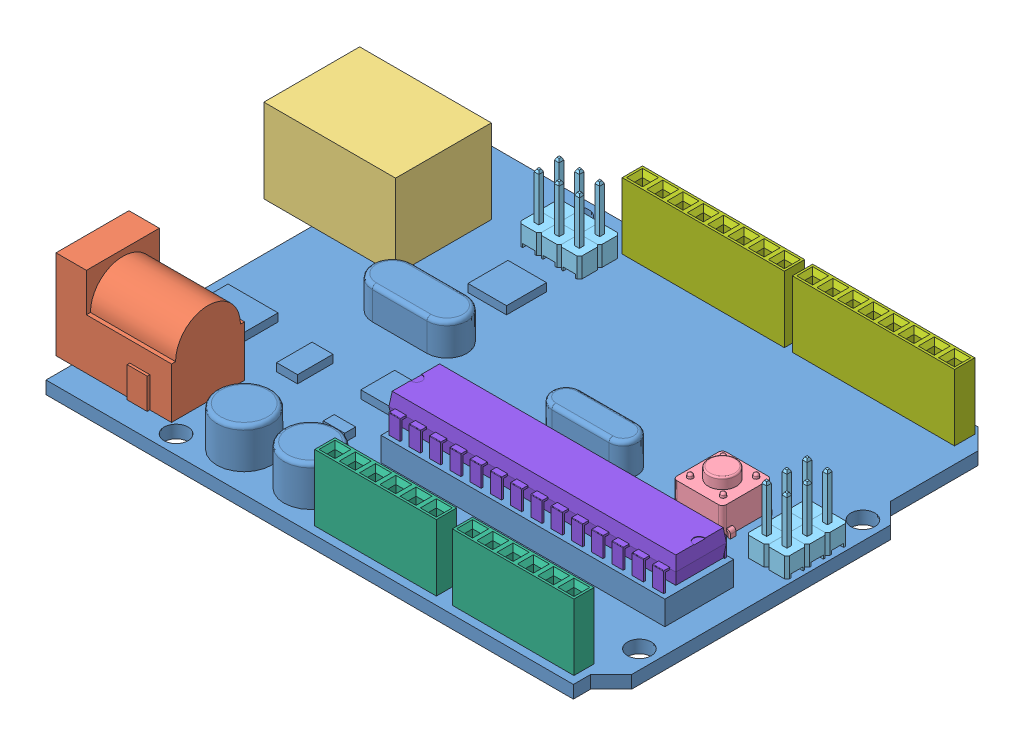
SolidWorks assembly User Library-Arduino-UNO.SLDASM, configuration Predeterminado (file format 4700). Lengths in mm.
Overall size (74.65 14.9 53.3).
15 component instances, 8 part files, 43 mates.
Components (placement in the parent):
- User Library-Arduino-UNO_Arduino_UNO_PCB-1: User Library-Arduino-UNO_Arduino_UNO_PCB.SLDPRT [Predeterminado] at (-41.2845 -4.4325 26.65) size (68.65 6.6 53.3)
- User Library-Arduino-UNO_User Library-Arduino Mega_DC POWER JACK-1: User Library-Arduino-UNO_User Library-Arduino Mega_DC POWER JACK.SLDPRT [Default] at (-43.2845 -2.8325 18.828) x (0 0 1) z (-1 0 0) size (9.47 14.78 14.48)
- User Library-Arduino-UNO_User Library-Arduino Mega_USB SM host-1: User Library-Arduino-UNO_User Library-Arduino Mega_USB SM host.SLDPRT [Default] at (-39.0345 2.4175 -12.65) x (0 0 1) z (-1 0 0) size (14.86 14.22 16.5)
- User Library-Arduino-UNO_User Library-Arduino Mega_tactile BUTTON-1: User Library-Arduino-UNO_User Library-Arduino Mega_tactile BUTTON.SLDPRT [Default] at (15.2655 -2.8325 -1.55) x (1 0 0) z (0 1 0) size (7.9 6.2 7.35)
- User Library-Arduino-UNO_User Library-Arduino Mega_Header Vertical 2_54mm Pitch4-1-3: User Library-Arduino-UNO_User Library-Arduino Mega_Header Vertical 2_54mm Pitch4-1.SLDPRT [2 Way] at (-21.2045 -2.8325 -20.11) size (2.54 9.3 5.08)
- User Library-Arduino-UNO_User Library-Arduino Mega_Header Vertical 2_54mm Pitch4-1-4: User Library-Arduino-UNO_User Library-Arduino Mega_Header Vertical 2_54mm Pitch4-1.SLDPRT [2 Way] at (-23.7445 -2.8325 -20.11) size (2.54 9.3 5.08)
- User Library-Arduino-UNO_User Library-Arduino Mega_Header Vertical 2_54mm Pitch4-1-5: User Library-Arduino-UNO_User Library-Arduino Mega_Header Vertical 2_54mm Pitch4-1.SLDPRT [2 Way] at (-26.2845 -2.8325 -20.11) size (2.54 9.3 5.08)
- User Library-Arduino-UNO_User Library-Arduino Mega_Header Vertical 2_54mm Pitch4-1-6: User Library-Arduino-UNO_User Library-Arduino Mega_Header Vertical 2_54mm Pitch4-1.SLDPRT [2 Way] at (24.3255 -2.8325 -3.11) x (0 0 -1) z (1 0 0) size (2.54 9.3 5.08)
- User Library-Arduino-UNO_User Library-Arduino Mega_Header Vertical 2_54mm Pitch4-1-7: User Library-Arduino-UNO_User Library-Arduino Mega_Header Vertical 2_54mm Pitch4-1.SLDPRT [2 Way] at (24.3255 -2.8325 1.97) x (0 0 -1) z (1 0 0) size (2.54 9.3 5.08)
- User Library-Arduino-UNO_User Library-Arduino Mega_Header Vertical 2_54mm Pitch4-1-8: User Library-Arduino-UNO_User Library-Arduino Mega_Header Vertical 2_54mm Pitch4-1.SLDPRT [2 Way] at (24.3255 -2.8325 -0.57) x (0 0 -1) z (1 0 0) size (2.54 9.3 5.08)
- User Library-Arduino-UNO_User Library-Arduino Mega_PIN HEADER FEMALE 6-1: User Library-Arduino-UNO_User Library-Arduino Mega_PIN HEADER FEMALE 6.SLDPRT [Default] at (-7.3445 -2.8325 24.38) size (15.24 8.3 2.54)
- User Library-Arduino-UNO_User Library-Arduino Mega_PIN HEADER FEMALE 6-2: User Library-Arduino-UNO_User Library-Arduino Mega_PIN HEADER FEMALE 6.SLDPRT [Default] at (9.8955 -2.8325 24.38) size (15.24 8.3 2.54)
- User Library-Arduino-UNO_User Library-Arduino Mega_PIN HEADER FEMALE 8-1: User Library-Arduino-UNO_User Library-Arduino Mega_PIN HEADER FEMALE 8.SLDPRT [Default] at (-17.5745 -2.8325 -24.38) size (20.32 8.3 2.54)
- User Library-Arduino-UNO_User Library-Arduino Mega_PIN HEADER FEMALE 8-2: User Library-Arduino-UNO_User Library-Arduino Mega_PIN HEADER FEMALE 8.SLDPRT [Default] at (3.7455 -2.8325 -24.38) size (20.32 8.3 2.54)
- User Library-Arduino-UNO_User Library-28 pin dip-1: User Library-Arduino-UNO_User Library-28 pin dip.SLDPRT [Default] at (1.315 2.5165 10.213) x (0 0 -1) z (1 0 0) size (7.87 6.22 35.94)
Mates (geometry in assembly coordinates):
- Coincidente1: coincident anti-aligned: plane of User Library-Arduino-UNO_Arduino_UNO_PCB-1 through (-41.2845 -2.8325 -26.65) normal (0 1 0); plane of User Library-Arduino-UNO_User Library-Arduino Mega_DC POWER JACK-1 through (-39.4745 -2.8325 14.256) normal (0 -1 0)
- Distancia1: distance = 2 mm aligned: plane of User Library-Arduino-UNO_Arduino_UNO_PCB-1 through (-41.2845 -2.8325 26.65) normal (-1 0 0); plane of User Library-Arduino-UNO_User Library-Arduino Mega_DC POWER JACK-1 through (-43.2845 8.3435 14.256) normal (-1 0 0)
- Distancia2: distance = 3.25 mm aligned: plane of User Library-Arduino-UNO_User Library-Arduino Mega_DC POWER JACK-1 through (-39.4745 -2.8325 23.4) normal (0 0 1); plane of User Library-Arduino-UNO_Arduino_UNO_PCB-1 through (24.7955 -2.8325 26.65) normal (0 0 1)
- Coincidente4: coincident anti-aligned: plane of User Library-Arduino-UNO_Arduino_UNO_PCB-1 through (-41.2845 -2.8325 -26.65) normal (0 1 0); plane of User Library-Arduino-UNO_User Library-Arduino Mega_USB SM host-1 through (-47.2845 -2.8325 -18.65) normal (0 -1 0)
- Distancia3: distance = 6 mm aligned: plane of User Library-Arduino-UNO_User Library-Arduino Mega_USB SM host-1 through (-47.2845 -2.8325 -18.65) normal (-1 0 0); plane of User Library-Arduino-UNO_Arduino_UNO_PCB-1 through (-41.2845 -2.8325 26.65) normal (-1 0 0)
- Distancia4: distance = 8 mm aligned: plane of User Library-Arduino-UNO_User Library-Arduino Mega_USB SM host-1 through (-47.2845 7.6675 -18.65) normal (0 0 -1); plane of User Library-Arduino-UNO_Arduino_UNO_PCB-1 through (-41.2845 -2.8325 -26.65) normal (0 0 -1)
- Coincidente7: coincident anti-aligned: plane of User Library-Arduino-UNO_Arduino_UNO_PCB-1 through (-41.2845 -2.8325 -26.65) normal (0 1 0); plane of User Library-Arduino-UNO_User Library-Arduino Mega_tactile BUTTON-1 through (12.1655 -2.8325 -4.65) normal (0 -1 0)
- Distancia5: distance = 9 mm aligned: plane of User Library-Arduino-UNO_User Library-Arduino Mega_tactile BUTTON-1 through (18.3655 0.6675 1.55) normal (1 0 0); plane of User Library-Arduino-UNO_Arduino_UNO_PCB-1 through (27.3655 -2.8325 -13.0888) normal (1 0 0)
- Distancia6: distance = 22 mm aligned: plane of User Library-Arduino-UNO_User Library-Arduino Mega_tactile BUTTON-1 through (12.1655 0.6675 -4.65) normal (0 0 -1); plane of User Library-Arduino-UNO_Arduino_UNO_PCB-1 through (-41.2845 -2.8325 -26.65) normal (0 0 -1)
- Coincidente10: coincident aligned: plane of User Library-Arduino-UNO_User Library-Arduino Mega_Header Vertical 2_54mm Pitch4-1-3 through (-22.1745 -0.3325 -18.84) normal (0 1 0); plane of User Library-Arduino-UNO_User Library-Arduino Mega_Header Vertical 2_54mm Pitch4-1-4 through (-24.7145 -0.3325 -18.84) normal (0 1 0)
- Coincidente11: coincident aligned: plane of User Library-Arduino-UNO_User Library-Arduino Mega_Header Vertical 2_54mm Pitch4-1-4 through (-24.7145 -0.3325 -18.84) normal (0 1 0); plane of User Library-Arduino-UNO_User Library-Arduino Mega_Header Vertical 2_54mm Pitch4-1-5 through (-27.2545 -0.3325 -18.84) normal (0 1 0)
- Coincidente12: coincident aligned: plane of User Library-Arduino-UNO_User Library-Arduino Mega_Header Vertical 2_54mm Pitch4-1-4 through (-23.4445 -0.3325 -17.57) normal (0 0 1); plane of User Library-Arduino-UNO_User Library-Arduino Mega_Header Vertical 2_54mm Pitch4-1-5 through (-25.9845 -0.3325 -17.57) normal (0 0 1)
- Coincidente13: coincident aligned: plane of User Library-Arduino-UNO_User Library-Arduino Mega_Header Vertical 2_54mm Pitch4-1-3 through (-20.9045 -0.3325 -17.57) normal (0 0 1); plane of User Library-Arduino-UNO_User Library-Arduino Mega_Header Vertical 2_54mm Pitch4-1-4 through (-23.4445 -0.3325 -17.57) normal (0 0 1)
- Coincidente14: coincident anti-aligned: plane of User Library-Arduino-UNO_User Library-Arduino Mega_Header Vertical 2_54mm Pitch4-1-3 through (-21.2045 -0.3325 -19.81) normal (-1 0 0); plane of User Library-Arduino-UNO_User Library-Arduino Mega_Header Vertical 2_54mm Pitch4-1-4 through (-21.2045 -0.3325 -17.87) normal (1 0 0)
- Coincidente15: coincident anti-aligned: plane of User Library-Arduino-UNO_User Library-Arduino Mega_Header Vertical 2_54mm Pitch4-1-4 through (-23.7445 -0.3325 -19.81) normal (-1 0 0); plane of User Library-Arduino-UNO_User Library-Arduino Mega_Header Vertical 2_54mm Pitch4-1-5 through (-23.7445 -0.3325 -17.87) normal (1 0 0)
- Coincidente16: coincident anti-aligned: plane of User Library-Arduino-UNO_Arduino_UNO_PCB-1 through (-41.2845 -2.8325 -26.65) normal (0 1 0); plane of User Library-Arduino-UNO_User Library-Arduino Mega_Header Vertical 2_54mm Pitch4-1-3 through (-22.1745 -2.8325 -18.84) normal (0 -1 0)
- Coincidente17: coincident aligned: plane of User Library-Arduino-UNO_User Library-Arduino Mega_Header Vertical 2_54mm Pitch4-1-7 through (25.5955 -0.3325 2.94) normal (0 1 0); plane of User Library-Arduino-UNO_User Library-Arduino Mega_Header Vertical 2_54mm Pitch4-1-8 through (23.0555 -0.3325 0.4) normal (0 1 0)
- Coincidente18: coincident aligned: plane of User Library-Arduino-UNO_User Library-Arduino Mega_Header Vertical 2_54mm Pitch4-1-6 through (25.5955 -0.3325 -2.14) normal (0 1 0); plane of User Library-Arduino-UNO_User Library-Arduino Mega_Header Vertical 2_54mm Pitch4-1-7 through (25.5955 -0.3325 2.94) normal (0 1 0)
- Coincidente19: coincident aligned: plane of User Library-Arduino-UNO_User Library-Arduino Mega_Header Vertical 2_54mm Pitch4-1-6 through (26.8655 -0.3325 -3.41) normal (1 0 0); plane of User Library-Arduino-UNO_User Library-Arduino Mega_Header Vertical 2_54mm Pitch4-1-7 through (26.8655 -0.3325 1.67) normal (1 0 0)
- Coincidente20: coincident aligned: plane of User Library-Arduino-UNO_User Library-Arduino Mega_Header Vertical 2_54mm Pitch4-1-7 through (26.8655 -0.3325 1.67) normal (1 0 0); plane of User Library-Arduino-UNO_User Library-Arduino Mega_Header Vertical 2_54mm Pitch4-1-8 through (26.8655 -0.3325 -0.87) normal (1 0 0)
- Coincidente21: coincident anti-aligned: plane of User Library-Arduino-UNO_User Library-Arduino Mega_Header Vertical 2_54mm Pitch4-1-6 through (24.6255 -0.3325 -3.11) normal (0 0 1); plane of User Library-Arduino-UNO_User Library-Arduino Mega_Header Vertical 2_54mm Pitch4-1-8 through (26.5655 -0.3325 -3.11) normal (0 0 -1)
- Coincidente22: coincident anti-aligned: plane of User Library-Arduino-UNO_User Library-Arduino Mega_Header Vertical 2_54mm Pitch4-1-7 through (26.5655 -0.3325 -0.57) normal (0 0 -1); plane of User Library-Arduino-UNO_User Library-Arduino Mega_Header Vertical 2_54mm Pitch4-1-8 through (24.6255 -0.3325 -0.57) normal (0 0 1)
- Coincidente23: coincident anti-aligned: plane of User Library-Arduino-UNO_Arduino_UNO_PCB-1 through (-41.2845 -2.8325 -26.65) normal (0 1 0); plane of User Library-Arduino-UNO_User Library-Arduino Mega_Header Vertical 2_54mm Pitch4-1-6 through (25.5955 -2.8325 -2.14) normal (0 -1 0)
- Distancia7: distance = 0.5 mm aligned: plane of User Library-Arduino-UNO_User Library-Arduino Mega_Header Vertical 2_54mm Pitch4-1-8 through (26.8655 -0.3325 -0.87) normal (1 0 0); plane of User Library-Arduino-UNO_Arduino_UNO_PCB-1 through (27.3655 -2.8325 -13.0888) normal (1 0 0)
- Distancia8: distance = 21 mm aligned: plane of User Library-Arduino-UNO_User Library-Arduino Mega_Header Vertical 2_54mm Pitch4-1-6 through (26.5655 -0.3325 -5.65) normal (0 0 -1); plane of User Library-Arduino-UNO_Arduino_UNO_PCB-1 through (-41.2845 -2.8325 -26.65) normal (0 0 -1)
- Distancia9: distance = 4 mm aligned: plane of User Library-Arduino-UNO_User Library-Arduino Mega_Header Vertical 2_54mm Pitch4-1-4 through (-21.5045 -0.3325 -22.65) normal (0 0 -1); plane of User Library-Arduino-UNO_Arduino_UNO_PCB-1 through (-41.2845 -2.8325 -26.65) normal (0 0 -1)
- Distancia10: distance = 15 mm aligned: plane of User Library-Arduino-UNO_User Library-Arduino Mega_Header Vertical 2_54mm Pitch4-1-5 through (-26.2845 -0.3325 -22.35) normal (-1 0 0); plane of User Library-Arduino-UNO_Arduino_UNO_PCB-1 through (-41.2845 -2.8325 26.65) normal (-1 0 0)
- Coincidente29: coincident aligned: plane of User Library-Arduino-UNO_User Library-Arduino Mega_PIN HEADER FEMALE 6-1 through (-8.6145 5.4675 25.65) normal (0 1 0); plane of User Library-Arduino-UNO_User Library-Arduino Mega_PIN HEADER FEMALE 6-2 through (8.6255 5.4675 25.65) normal (0 1 0)
- Coincidente30: coincident aligned: plane of User Library-Arduino-UNO_User Library-Arduino Mega_PIN HEADER FEMALE 8-1 through (-18.8445 5.4675 -23.11) normal (0 1 0); plane of User Library-Arduino-UNO_User Library-Arduino Mega_PIN HEADER FEMALE 8-2 through (2.4755 5.4675 -23.11) normal (0 1 0)
- Coincidente31: coincident anti-aligned: plane of User Library-Arduino-UNO_Arduino_UNO_PCB-1 through (-41.2845 -2.8325 -26.65) normal (0 1 0); plane of User Library-Arduino-UNO_User Library-Arduino Mega_PIN HEADER FEMALE 8-1 through (-18.8445 -2.8325 -23.11) normal (0 -1 0)
- Coincidente32: coincident aligned: plane of User Library-Arduino-UNO_User Library-Arduino Mega_PIN HEADER FEMALE 8-1 through (-16.3045 5.4675 -23.11) normal (0 0 1); plane of User Library-Arduino-UNO_User Library-Arduino Mega_PIN HEADER FEMALE 8-2 through (5.0155 5.4675 -23.11) normal (0 0 1)
- Coincidente33: coincident aligned: plane of User Library-Arduino-UNO_User Library-Arduino Mega_PIN HEADER FEMALE 6-1 through (-6.0745 5.4675 25.65) normal (0 0 1); plane of User Library-Arduino-UNO_User Library-Arduino Mega_PIN HEADER FEMALE 6-2 through (11.1655 5.4675 25.65) normal (0 0 1)
- Coincidente34: coincident anti-aligned: plane of User Library-Arduino-UNO_Arduino_UNO_PCB-1 through (-41.2845 -2.8325 -26.65) normal (0 1 0); plane of User Library-Arduino-UNO_User Library-Arduino Mega_PIN HEADER FEMALE 6-1 through (-8.6145 -2.8325 25.65) normal (0 -1 0)
- Distancia11: distance = 2 mm anti-aligned: plane of User Library-Arduino-UNO_User Library-Arduino Mega_PIN HEADER FEMALE 6-2 through (8.6255 5.4675 25.65) normal (-1 0 0); plane of User Library-Arduino-UNO_User Library-Arduino Mega_PIN HEADER FEMALE 6-1 through (6.6255 5.4675 25.65) normal (1 0 0)
- Distancia12: distance = 1 mm anti-aligned: plane of User Library-Arduino-UNO_User Library-Arduino Mega_PIN HEADER FEMALE 8-1 through (1.4755 5.4675 -23.11) normal (1 0 0); plane of User Library-Arduino-UNO_User Library-Arduino Mega_PIN HEADER FEMALE 8-2 through (2.4755 5.4675 -23.11) normal (-1 0 0)
- Distancia13: distance = 1 mm aligned: plane of User Library-Arduino-UNO_User Library-Arduino Mega_PIN HEADER FEMALE 6-2 through (11.1655 5.4675 25.65) normal (0 0 1); plane of User Library-Arduino-UNO_Arduino_UNO_PCB-1 through (24.7955 -2.8325 26.65) normal (0 0 1)
- Distancia14: distance = 3.5 mm aligned: plane of User Library-Arduino-UNO_User Library-Arduino Mega_PIN HEADER FEMALE 6-2 through (23.8655 5.4675 25.65) normal (1 0 0); plane of User Library-Arduino-UNO_Arduino_UNO_PCB-1 through (27.3655 -2.8325 -13.0888) normal (1 0 0)
- Distancia15: distance = 1 mm aligned: plane of User Library-Arduino-UNO_Arduino_UNO_PCB-1 through (-41.2845 -2.8325 -26.65) normal (0 0 -1); plane of User Library-Arduino-UNO_User Library-Arduino Mega_PIN HEADER FEMALE 8-2 through (5.0155 5.4675 -25.65) normal (0 0 -1)
- Distancia16: distance = 2 mm aligned: plane of User Library-Arduino-UNO_User Library-Arduino Mega_PIN HEADER FEMALE 8-2 through (22.7955 5.4675 -23.11) normal (1 0 0); plane of User Library-Arduino-UNO_Arduino_UNO_PCB-1 through (24.7955 -2.8325 -26.65) normal (1 0 0)
- Distancia18: distance = 7 mm aligned: plane of User Library-Arduino-UNO_Arduino_UNO_PCB-1 through (-41.2845 -2.8325 -26.65) normal (0 1 0); plane of User Library-Arduino-UNO_User Library-28 pin dip-1 through (14.2055 4.1675 13.388) normal (0 1 0)
- Paralelo1: parallel anti-aligned: plane of User Library-Arduino-UNO_Arduino_UNO_PCB-1 through (24.7955 -2.8325 26.65) normal (0 0 1); plane of User Library-Arduino-UNO_User Library-28 pin dip-1 through (1.8865 2.6435 6.276) normal (0 0 -1)
- Distancia19: distance = 3 mm: plane of User Library-Arduino-UNO_Arduino_UNO_PCB-1 through (27.3655 -2.8325 -13.0888) normal (1 0 0); line of User Library-Arduino-UNO_User Library-28 pin dip-1 through (24.3655 2.5165 7.038) axis (0 0 1)
- Distancia20: distance = 12.5 mm aligned: plane of User Library-Arduino-UNO_User Library-28 pin dip-1 through (21.0635 2.6435 14.15) normal (0 0 1); plane of User Library-Arduino-UNO_Arduino_UNO_PCB-1 through (24.7955 -2.8325 26.65) normal (0 0 1)
